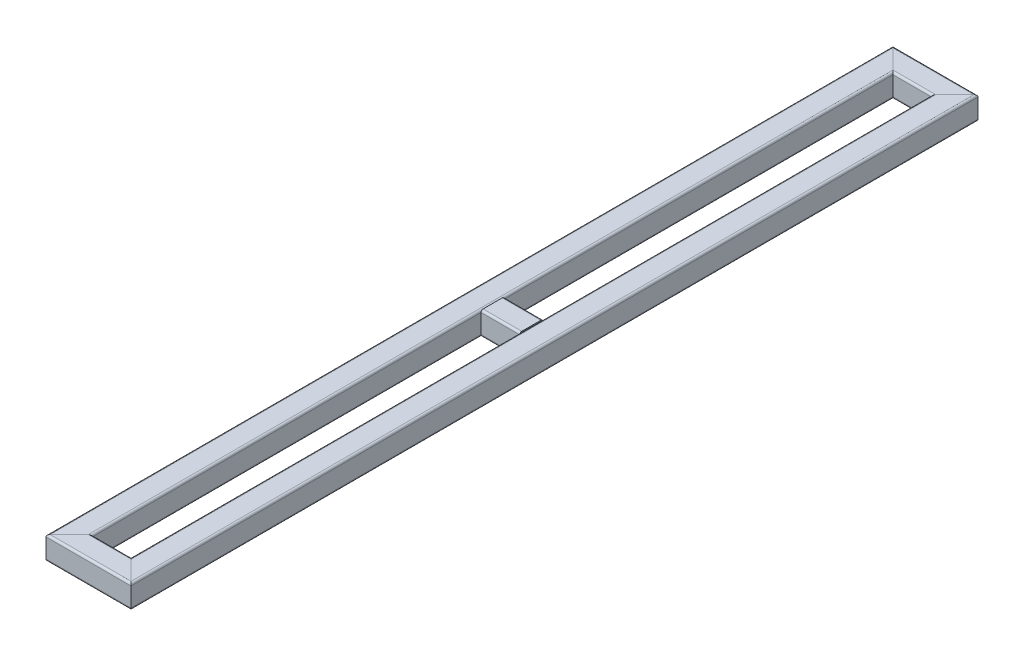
from build123d import *

# Parameters (mm, degrees)
EL_MENT_M_CANO_SOUD_1_DEPTH      = 1630.819805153
EL_MENT_M_CANO_SOUD_1_DEPTH_BACK = 32.819805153
EL_MENT_M_CANO_SOUD_1_2_DEPTH    = 185.639610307
EL_MENT_M_CANO_SOUD_1_3_DEPTH    = 1663.639610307
EL_MENT_M_CANO_SOUD_1_4_DEPTH    = 185.639610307
EL_MENT_M_CANO_SOUD_1_5_DEPTH    = 122


with BuildPart() as part:
    # Sketch11 → El_ment m_cano-soud_1 (new, two sides: drawn at the far end of the back side and taken through both)
    with BuildSketch(Plane.XY.offset(-1598).offset(-EL_MENT_M_CANO_SOUD_1_DEPTH_BACK)):
        with BuildLine():
            Line((-18.5, -22.5), (18.5, -22.5))
            ThreePointArc((18.5, -22.5), (21.328427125, -21.328427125), (22.5, -18.5))
            Line((22.5, -18.5), (22.5, 18.5))
            ThreePointArc((22.5, 18.5), (21.328427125, 21.328427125), (18.5, 22.5))
            Line((18.5, 22.5), (-18.5, 22.5))
            ThreePointArc((-18.5, 22.5), (-21.328427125, 21.328427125), (-22.5, 18.5))
            Line((-22.5, 18.5), (-22.5, -18.5))
            ThreePointArc((-22.5, -18.5), (-21.328427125, -21.328427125), (-18.5, -22.5))
        make_face()
        with BuildLine():
            Line((-18.5, -20.5), (18.5, -20.5))
            ThreePointArc((18.5, -20.5), (19.914213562, -19.914213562), (20.5, -18.5))
            Line((20.5, -18.5), (20.5, 18.5))
            ThreePointArc((20.5, 18.5), (19.914213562, 19.914213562), (18.5, 20.5))
            Line((18.5, 20.5), (-18.5, 20.5))
            ThreePointArc((-18.5, 20.5), (-19.914213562, 19.914213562), (-20.5, 18.5))
            Line((-20.5, 18.5), (-20.5, -18.5))
            ThreePointArc((-20.5, -18.5), (-19.914213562, -19.914213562), (-18.5, -20.5))
        make_face(mode=Mode.SUBTRACT)
    extrude(amount=EL_MENT_M_CANO_SOUD_1_DEPTH + EL_MENT_M_CANO_SOUD_1_DEPTH_BACK)

    # El_ment m_cano-soud_1 mitre 1
    split(bisect_by=Plane(origin=(0, 0, -1598), x_dir=(0, -1, 0), z_dir=(-0.707106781, 0, 0.707106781)), keep=Keep.TOP)

    # El_ment m_cano-soud_1 mitre 2
    split(bisect_by=Plane(origin=(0, 0, 0), x_dir=(0, -1, 0), z_dir=(-0.707106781, 0, -0.707106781)), keep=Keep.TOP)


with BuildPart() as body_2:
    # Sketch11 on segment 2 (on carried to segment 2) → El_ment m_cano-soud_1 2 (new body)
    with BuildSketch(Plane(origin=(-32.819805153, 0, 0), x_dir=(0, 0, -1), z_dir=(1, 0, 0))):
        with BuildLine():
            Line((-18.5, -22.5), (18.5, -22.5))
            ThreePointArc((18.5, -22.5), (21.328427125, -21.328427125), (22.5, -18.5))
            Line((22.5, -18.5), (22.5, 18.5))
            ThreePointArc((22.5, 18.5), (21.328427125, 21.328427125), (18.5, 22.5))
            Line((18.5, 22.5), (-18.5, 22.5))
            ThreePointArc((-18.5, 22.5), (-21.328427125, 21.328427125), (-22.5, 18.5))
            Line((-22.5, 18.5), (-22.5, -18.5))
            ThreePointArc((-22.5, -18.5), (-21.328427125, -21.328427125), (-18.5, -22.5))
        make_face()
        with BuildLine():
            Line((-18.5, -20.5), (18.5, -20.5))
            ThreePointArc((18.5, -20.5), (19.914213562, -19.914213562), (20.5, -18.5))
            Line((20.5, -18.5), (20.5, 18.5))
            ThreePointArc((20.5, 18.5), (19.914213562, 19.914213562), (18.5, 20.5))
            Line((18.5, 20.5), (-18.5, 20.5))
            ThreePointArc((-18.5, 20.5), (-19.914213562, 19.914213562), (-20.5, 18.5))
            Line((-20.5, 18.5), (-20.5, -18.5))
            ThreePointArc((-20.5, -18.5), (-19.914213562, -19.914213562), (-18.5, -20.5))
        make_face(mode=Mode.SUBTRACT)
    extrude(amount=EL_MENT_M_CANO_SOUD_1_2_DEPTH)

    # El_ment m_cano-soud_1 2 mitre 1
    split(bisect_by=Plane(origin=(0, 0, 0), x_dir=(0, 1, 0), z_dir=(0.707106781, 0, 0.707106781)), keep=Keep.TOP)

    # El_ment m_cano-soud_1 2 mitre 2
    split(bisect_by=Plane(origin=(120, 0, 0), x_dir=(0, -1, 0), z_dir=(-0.707106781, 0, 0.707106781)), keep=Keep.TOP)


with BuildPart() as body_3:
    # Sketch11 on segment 3 (on carried to segment 3) → El_ment m_cano-soud_1 3 (new body)
    with BuildSketch(Plane(origin=(120, 0, 32.819805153), x_dir=(-1, 0, 0), z_dir=(0, 0, -1))):
        with BuildLine():
            Line((-18.5, -22.5), (18.5, -22.5))
            ThreePointArc((18.5, -22.5), (21.328427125, -21.328427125), (22.5, -18.5))
            Line((22.5, -18.5), (22.5, 18.5))
            ThreePointArc((22.5, 18.5), (21.328427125, 21.328427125), (18.5, 22.5))
            Line((18.5, 22.5), (-18.5, 22.5))
            ThreePointArc((-18.5, 22.5), (-21.328427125, 21.328427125), (-22.5, 18.5))
            Line((-22.5, 18.5), (-22.5, -18.5))
            ThreePointArc((-22.5, -18.5), (-21.328427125, -21.328427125), (-18.5, -22.5))
        make_face()
        with BuildLine():
            Line((-18.5, -20.5), (18.5, -20.5))
            ThreePointArc((18.5, -20.5), (19.914213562, -19.914213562), (20.5, -18.5))
            Line((20.5, -18.5), (20.5, 18.5))
            ThreePointArc((20.5, 18.5), (19.914213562, 19.914213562), (18.5, 20.5))
            Line((18.5, 20.5), (-18.5, 20.5))
            ThreePointArc((-18.5, 20.5), (-19.914213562, 19.914213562), (-20.5, 18.5))
            Line((-20.5, 18.5), (-20.5, -18.5))
            ThreePointArc((-20.5, -18.5), (-19.914213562, -19.914213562), (-18.5, -20.5))
        make_face(mode=Mode.SUBTRACT)
    extrude(amount=EL_MENT_M_CANO_SOUD_1_3_DEPTH)

    # El_ment m_cano-soud_1 3 mitre 1
    split(bisect_by=Plane(origin=(120, 0, 0), x_dir=(0, 1, 0), z_dir=(0.707106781, 0, -0.707106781)), keep=Keep.TOP)

    # El_ment m_cano-soud_1 3 mitre 2
    split(bisect_by=Plane(origin=(120, 0, -1598), x_dir=(0, 1, 0), z_dir=(0.707106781, 0, 0.707106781)), keep=Keep.TOP)


with BuildPart() as body_4:
    # Sketch11 on segment 4 (on carried to segment 4) → El_ment m_cano-soud_1 4 (new body)
    with BuildSketch(Plane(origin=(152.819805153, 0, -1598), x_dir=(0, 0, 1), z_dir=(-1, 0, 0))):
        with BuildLine():
            Line((-18.5, -22.5), (18.5, -22.5))
            ThreePointArc((18.5, -22.5), (21.328427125, -21.328427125), (22.5, -18.5))
            Line((22.5, -18.5), (22.5, 18.5))
            ThreePointArc((22.5, 18.5), (21.328427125, 21.328427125), (18.5, 22.5))
            Line((18.5, 22.5), (-18.5, 22.5))
            ThreePointArc((-18.5, 22.5), (-21.328427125, 21.328427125), (-22.5, 18.5))
            Line((-22.5, 18.5), (-22.5, -18.5))
            ThreePointArc((-22.5, -18.5), (-21.328427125, -21.328427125), (-18.5, -22.5))
        make_face()
        with BuildLine():
            Line((-18.5, -20.5), (18.5, -20.5))
            ThreePointArc((18.5, -20.5), (19.914213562, -19.914213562), (20.5, -18.5))
            Line((20.5, -18.5), (20.5, 18.5))
            ThreePointArc((20.5, 18.5), (19.914213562, 19.914213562), (18.5, 20.5))
            Line((18.5, 20.5), (-18.5, 20.5))
            ThreePointArc((-18.5, 20.5), (-19.914213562, 19.914213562), (-20.5, 18.5))
            Line((-20.5, 18.5), (-20.5, -18.5))
            ThreePointArc((-20.5, -18.5), (-19.914213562, -19.914213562), (-18.5, -20.5))
        make_face(mode=Mode.SUBTRACT)
    extrude(amount=EL_MENT_M_CANO_SOUD_1_4_DEPTH)

    # El_ment m_cano-soud_1 4 mitre 1
    split(bisect_by=Plane(origin=(120, 0, -1598), x_dir=(0, -1, 0), z_dir=(-0.707106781, 0, -0.707106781)), keep=Keep.TOP)

    # El_ment m_cano-soud_1 4 mitre 2
    split(bisect_by=Plane(origin=(0, 0, -1598), x_dir=(0, 1, 0), z_dir=(0.707106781, 0, -0.707106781)), keep=Keep.TOP)


with BuildPart() as body_5:
    # Sketch11 on segment 5 (on carried to segment 5) → El_ment m_cano-soud_1 5 (new body)
    with BuildSketch(Plane(origin=(-1, 0, -799), x_dir=(0, 0, -1), z_dir=(1, 0, 0))):
        with BuildLine():
            Line((-18.5, -22.5), (18.5, -22.5))
            ThreePointArc((18.5, -22.5), (21.328427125, -21.328427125), (22.5, -18.5))
            Line((22.5, -18.5), (22.5, 18.5))
            ThreePointArc((22.5, 18.5), (21.328427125, 21.328427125), (18.5, 22.5))
            Line((18.5, 22.5), (-18.5, 22.5))
            ThreePointArc((-18.5, 22.5), (-21.328427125, 21.328427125), (-22.5, 18.5))
            Line((-22.5, 18.5), (-22.5, -18.5))
            ThreePointArc((-22.5, -18.5), (-21.328427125, -21.328427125), (-18.5, -22.5))
        make_face()
        with BuildLine():
            Line((-18.5, -20.5), (18.5, -20.5))
            ThreePointArc((18.5, -20.5), (19.914213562, -19.914213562), (20.5, -18.5))
            Line((20.5, -18.5), (20.5, 18.5))
            ThreePointArc((20.5, 18.5), (19.914213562, 19.914213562), (18.5, 20.5))
            Line((18.5, 20.5), (-18.5, 20.5))
            ThreePointArc((-18.5, 20.5), (-19.914213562, 19.914213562), (-20.5, 18.5))
            Line((-20.5, 18.5), (-20.5, -18.5))
            ThreePointArc((-20.5, -18.5), (-19.914213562, -19.914213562), (-18.5, -20.5))
        make_face(mode=Mode.SUBTRACT)
    extrude(amount=EL_MENT_M_CANO_SOUD_1_5_DEPTH)

    # El_ment m_cano-soud_1 5 mitre 1
    split(bisect_by=Plane(origin=(22.5, 0, -799), x_dir=(0, 1, 0), z_dir=(1, 0, 0)), keep=Keep.TOP)

    # El_ment m_cano-soud_1 5 mitre 2
    split(bisect_by=Plane(origin=(97.5, 0, -799), x_dir=(0, -1, 0), z_dir=(-1, 0, 0)), keep=Keep.TOP)


solid = Compound([part.part, body_2.part, body_3.part, body_4.part, body_5.part])
